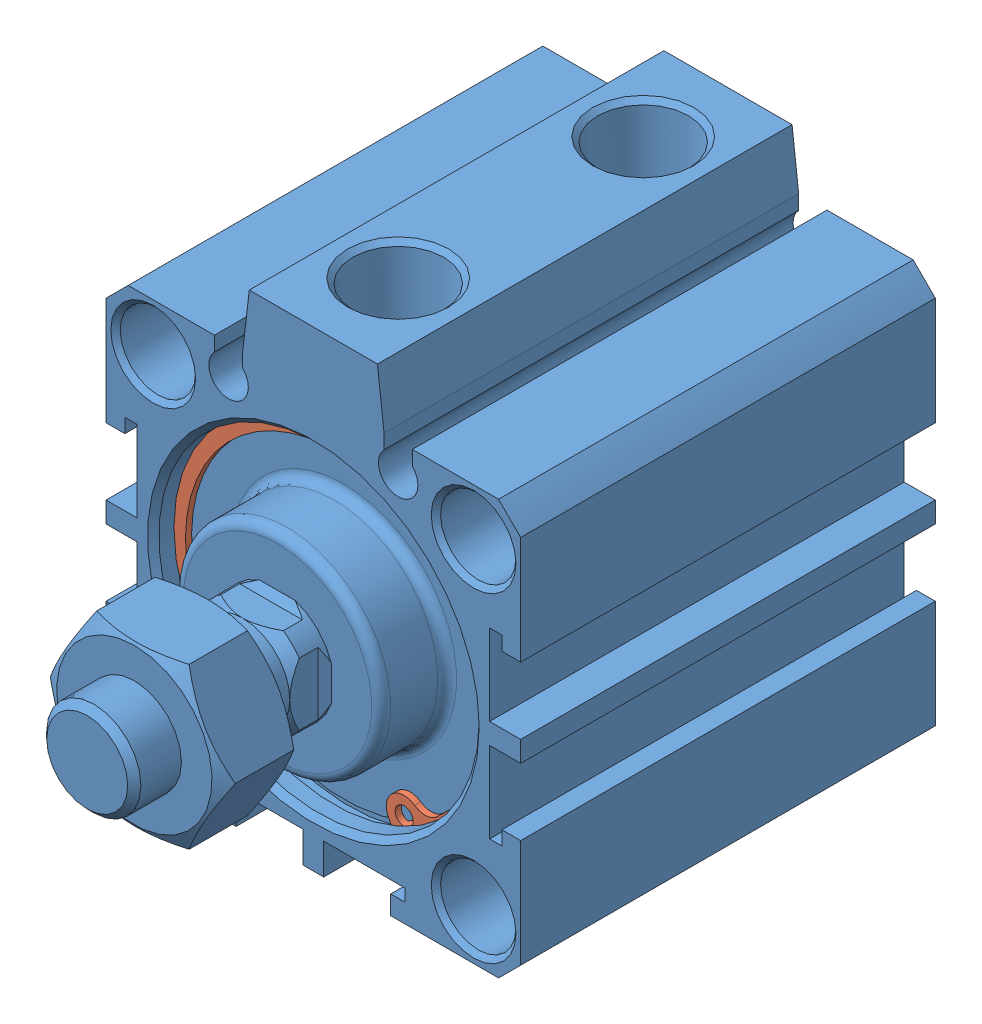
SolidWorks assembly JD32x10-BS.sldasm, configuration 默认 (file format 4400). Lengths in mm.
Overall size (44 50 68).
3 component instances, 2 part files, 0 mates.
Components (placement in the parent):
- JD32x10-BS-1: JD32x10-BS.sldprt [默认] at origin size (44 50 68)
- R _X2_5F6274B0_X0_ 35-1: R _X2_5F6274B0_X0_ 35.sldprt [默认] at (2.2727 17.5981 40.15) size (37.2 36.09 1.3)
- R _X2_5F6274B0_X0_ 35-2: R _X2_5F6274B0_X0_ 35.sldprt [默认] at (2.2727 17.5981 2.55) size (37.2 36.09 1.3)
